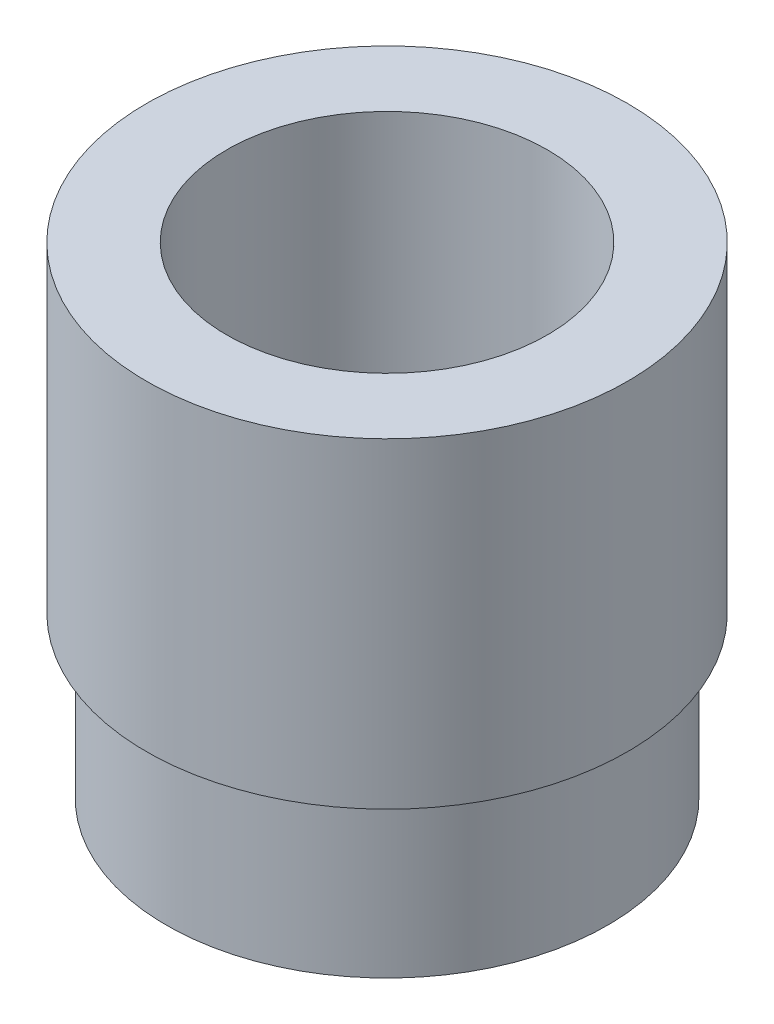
ISO-10303-21;
HEADER;
FILE_DESCRIPTION(('STEP AP214'),'2;1');
FILE_NAME('part.step','',(''),(''),'','','');
FILE_SCHEMA(('AUTOMOTIVE_DESIGN { 1 0 10303 214 1 1 1 1 }'));
ENDSEC;
DATA;
#1=APPLICATION_CONTEXT('core data for automotive mechanical design processes');
#2=APPLICATION_PROTOCOL_DEFINITION('international standard','automotive_design',2000,#1);
#3=PRODUCT_CONTEXT('',#1,'mechanical');
#4=PRODUCT('Part','Part','',(#3));
#5=PRODUCT_RELATED_PRODUCT_CATEGORY('part','',(#4));
#6=PRODUCT_DEFINITION_FORMATION('','',#4);
#7=PRODUCT_DEFINITION_CONTEXT('part definition',#1,'design');
#8=PRODUCT_DEFINITION('design','',#6,#7);
#9=PRODUCT_DEFINITION_SHAPE('','',#8);
#10=(LENGTH_UNIT() NAMED_UNIT(*) SI_UNIT(.MILLI.,.METRE.));
#11=(NAMED_UNIT(*) PLANE_ANGLE_UNIT() SI_UNIT($,.RADIAN.));
#12=(NAMED_UNIT(*) SI_UNIT($,.STERADIAN.) SOLID_ANGLE_UNIT());
#13=UNCERTAINTY_MEASURE_WITH_UNIT(LENGTH_MEASURE(1.E-05),#10,'distance_accuracy_value','');
#14=(GEOMETRIC_REPRESENTATION_CONTEXT(3) GLOBAL_UNCERTAINTY_ASSIGNED_CONTEXT((#13)) GLOBAL_UNIT_ASSIGNED_CONTEXT((#10,
#11,#12)) REPRESENTATION_CONTEXT('',''));
#15=CARTESIAN_POINT('',(0.,0.,0.));
#16=DIRECTION('',(0.,0.,1.));
#17=DIRECTION('',(1.,0.,0.));
#18=AXIS2_PLACEMENT_3D('',#15,#16,#17);
#19=CARTESIAN_POINT('',(0.,25.4,-12.7));
#20=DIRECTION('',(0.,1.,0.));
#21=DIRECTION('',(0.,0.,1.));
#22=AXIS2_PLACEMENT_3D('',#19,#20,#21);
#23=PLANE('',#22);
#24=CARTESIAN_POINT('',(0.,25.4,0.));
#25=DIRECTION('',(0.,-1.,0.));
#26=DIRECTION('',(0.,0.,-1.));
#27=AXIS2_PLACEMENT_3D('',#24,#25,#26);
#28=CIRCLE('',#27,12.7);
#29=CARTESIAN_POINT('',(0.,25.4,-12.7));
#30=VERTEX_POINT('',#29);
#31=EDGE_CURVE('E58',#30,#30,#28,.T.);
#32=ORIENTED_EDGE('',*,*,#31,.T.);
#33=EDGE_LOOP('',(#32));
#34=FACE_BOUND('',#33,.T.);
#35=CARTESIAN_POINT('',(0.,25.4,0.));
#36=DIRECTION('',(0.,-1.,0.));
#37=DIRECTION('',(0.,0.,-1.));
#38=AXIS2_PLACEMENT_3D('',#35,#36,#37);
#39=CIRCLE('',#38,19.05);
#40=CARTESIAN_POINT('',(0.,25.4,-19.05));
#41=VERTEX_POINT('',#40);
#42=EDGE_CURVE('E10',#41,#41,#39,.T.);
#43=ORIENTED_EDGE('',*,*,#42,.F.);
#44=EDGE_LOOP('',(#43));
#45=FACE_BOUND('',#44,.T.);
#46=ADVANCED_FACE('F36',(#34,#45),#23,.T.);
#47=CARTESIAN_POINT('',(0.,0.,0.));
#48=DIRECTION('',(0.,-1.,0.));
#49=DIRECTION('',(0.,0.,-1.));
#50=AXIS2_PLACEMENT_3D('',#47,#48,#49);
#51=CYLINDRICAL_SURFACE('',#50,19.05);
#52=ORIENTED_EDGE('',*,*,#42,.T.);
#53=EDGE_LOOP('',(#52));
#54=FACE_BOUND('',#53,.T.);
#55=CARTESIAN_POINT('',(0.,0.,0.));
#56=DIRECTION('',(0.,-1.,0.));
#57=DIRECTION('',(0.,0.,-1.));
#58=AXIS2_PLACEMENT_3D('',#55,#56,#57);
#59=CIRCLE('',#58,19.05);
#60=CARTESIAN_POINT('',(0.,0.,-19.05));
#61=VERTEX_POINT('',#60);
#62=EDGE_CURVE('E42',#61,#61,#59,.T.);
#63=ORIENTED_EDGE('',*,*,#62,.F.);
#64=EDGE_LOOP('',(#63));
#65=FACE_BOUND('',#64,.T.);
#66=ADVANCED_FACE('F76',(#54,#65),#51,.T.);
#67=CARTESIAN_POINT('',(0.,0.,-19.05));
#68=DIRECTION('',(0.,-1.,0.));
#69=DIRECTION('',(0.,0.,-1.));
#70=AXIS2_PLACEMENT_3D('',#67,#68,#69);
#71=PLANE('',#70);
#72=ORIENTED_EDGE('',*,*,#62,.T.);
#73=EDGE_LOOP('',(#72));
#74=FACE_BOUND('',#73,.T.);
#75=CARTESIAN_POINT('',(0.,0.,0.));
#76=DIRECTION('',(0.,-1.,0.));
#77=DIRECTION('',(0.,0.,-1.));
#78=AXIS2_PLACEMENT_3D('',#75,#76,#77);
#79=CIRCLE('',#78,17.4625);
#80=CARTESIAN_POINT('',(0.,0.,-17.4625));
#81=VERTEX_POINT('',#80);
#82=EDGE_CURVE('E46',#81,#81,#79,.T.);
#83=ORIENTED_EDGE('',*,*,#82,.F.);
#84=EDGE_LOOP('',(#83));
#85=FACE_BOUND('',#84,.T.);
#86=ADVANCED_FACE('F80',(#74,#85),#71,.T.);
#87=CARTESIAN_POINT('',(0.,0.,0.));
#88=DIRECTION('',(0.,-1.,0.));
#89=DIRECTION('',(0.,0.,-1.));
#90=AXIS2_PLACEMENT_3D('',#87,#88,#89);
#91=CYLINDRICAL_SURFACE('',#90,17.4625);
#92=ORIENTED_EDGE('',*,*,#82,.T.);
#93=EDGE_LOOP('',(#92));
#94=FACE_BOUND('',#93,.T.);
#95=CARTESIAN_POINT('',(0.,-12.7,0.));
#96=DIRECTION('',(0.,-1.,0.));
#97=DIRECTION('',(0.,0.,-1.));
#98=AXIS2_PLACEMENT_3D('',#95,#96,#97);
#99=CIRCLE('',#98,17.4625);
#100=CARTESIAN_POINT('',(0.,-12.7,-17.4625));
#101=VERTEX_POINT('',#100);
#102=EDGE_CURVE('E50',#101,#101,#99,.T.);
#103=ORIENTED_EDGE('',*,*,#102,.F.);
#104=EDGE_LOOP('',(#103));
#105=FACE_BOUND('',#104,.T.);
#106=ADVANCED_FACE('F72',(#94,#105),#91,.T.);
#107=CARTESIAN_POINT('',(0.,-12.7,-17.4625));
#108=DIRECTION('',(0.,-1.,0.));
#109=DIRECTION('',(0.,0.,-1.));
#110=AXIS2_PLACEMENT_3D('',#107,#108,#109);
#111=PLANE('',#110);
#112=ORIENTED_EDGE('',*,*,#102,.T.);
#113=EDGE_LOOP('',(#112));
#114=FACE_BOUND('',#113,.T.);
#115=CARTESIAN_POINT('',(0.,-12.7,0.));
#116=DIRECTION('',(0.,-1.,0.));
#117=DIRECTION('',(0.,0.,-1.));
#118=AXIS2_PLACEMENT_3D('',#115,#116,#117);
#119=CIRCLE('',#118,12.7);
#120=CARTESIAN_POINT('',(0.,-12.7,-12.7));
#121=VERTEX_POINT('',#120);
#122=EDGE_CURVE('E55',#121,#121,#119,.T.);
#123=ORIENTED_EDGE('',*,*,#122,.F.);
#124=EDGE_LOOP('',(#123));
#125=FACE_BOUND('',#124,.T.);
#126=ADVANCED_FACE('F66',(#114,#125),#111,.T.);
#127=CARTESIAN_POINT('',(0.,0.,0.));
#128=DIRECTION('',(0.,-1.,0.));
#129=DIRECTION('',(0.,0.,-1.));
#130=AXIS2_PLACEMENT_3D('',#127,#128,#129);
#131=CYLINDRICAL_SURFACE('',#130,12.7);
#132=ORIENTED_EDGE('',*,*,#122,.T.);
#133=EDGE_LOOP('',(#132));
#134=FACE_BOUND('',#133,.T.);
#135=ORIENTED_EDGE('',*,*,#31,.F.);
#136=EDGE_LOOP('',(#135));
#137=FACE_BOUND('',#136,.T.);
#138=ADVANCED_FACE('F64',(#134,#137),#131,.F.);
#139=CLOSED_SHELL('',(#46,#66,#86,#106,#126,#138));
#140=MANIFOLD_SOLID_BREP('B2',#139);
#141=ADVANCED_BREP_SHAPE_REPRESENTATION('',(#18,#140),#14);
#142=SHAPE_DEFINITION_REPRESENTATION(#9,#141);
ENDSEC;
END-ISO-10303-21;
